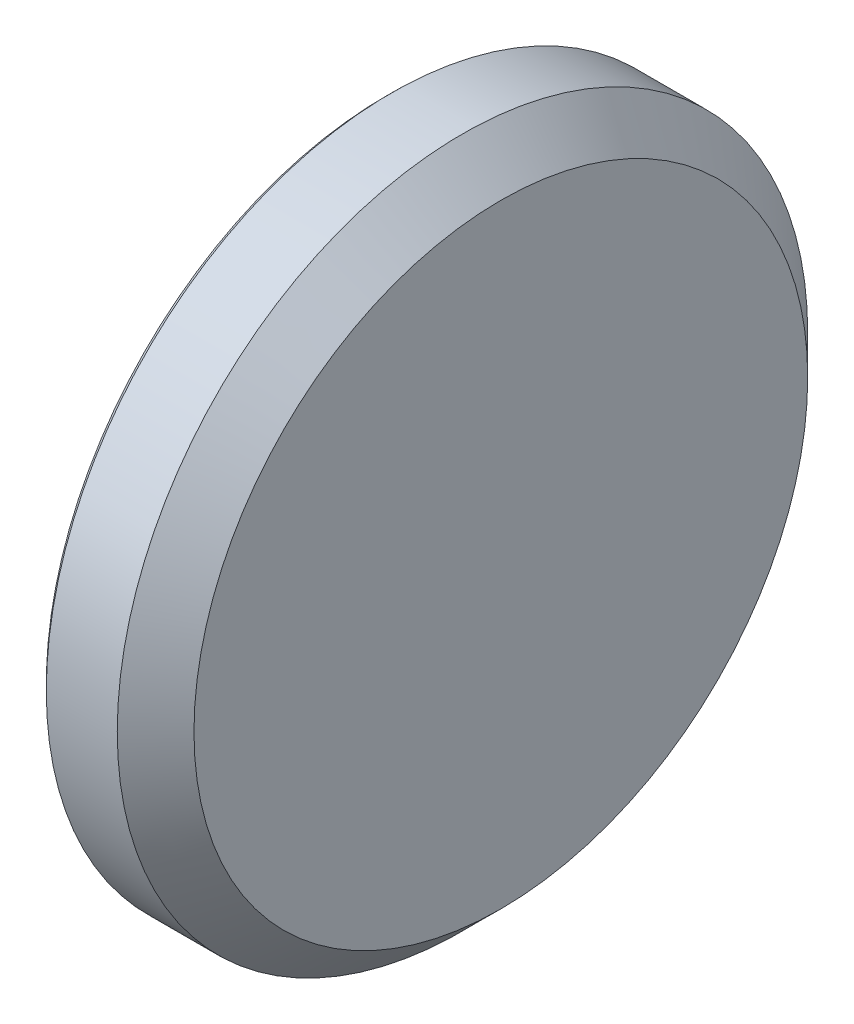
from build123d import *

# Parameters (mm, degrees)
SKETCH_1_R      = 9
EXTRUDE_1_DEPTH = 3
CHAMFER_1_SIZE  = 1
CHAMFER_2_SIZE  = 0.15


with BuildPart() as part:
    # Sketch 1 → Extrude 1 (new body)
    with BuildSketch(Plane(origin=(0, 0, 0), x_dir=(0, 0, -1), z_dir=(1, 0, 0))):
        Circle(SKETCH_1_R)
    extrude(amount=EXTRUDE_1_DEPTH)

    # Chamfer 1
    chamfer_1_edges = [part.edges().sort_by_distance(p)[0] for p in [
        (3, 0, 9),
    ]]
    chamfer(chamfer_1_edges, length=CHAMFER_1_SIZE)

    # Chamfer 2
    chamfer_2_edges = [part.edges().sort_by_distance(p)[0] for p in [
        (0, 0, 9),
    ]]
    chamfer(chamfer_2_edges, length=CHAMFER_2_SIZE)


solid = part.part
